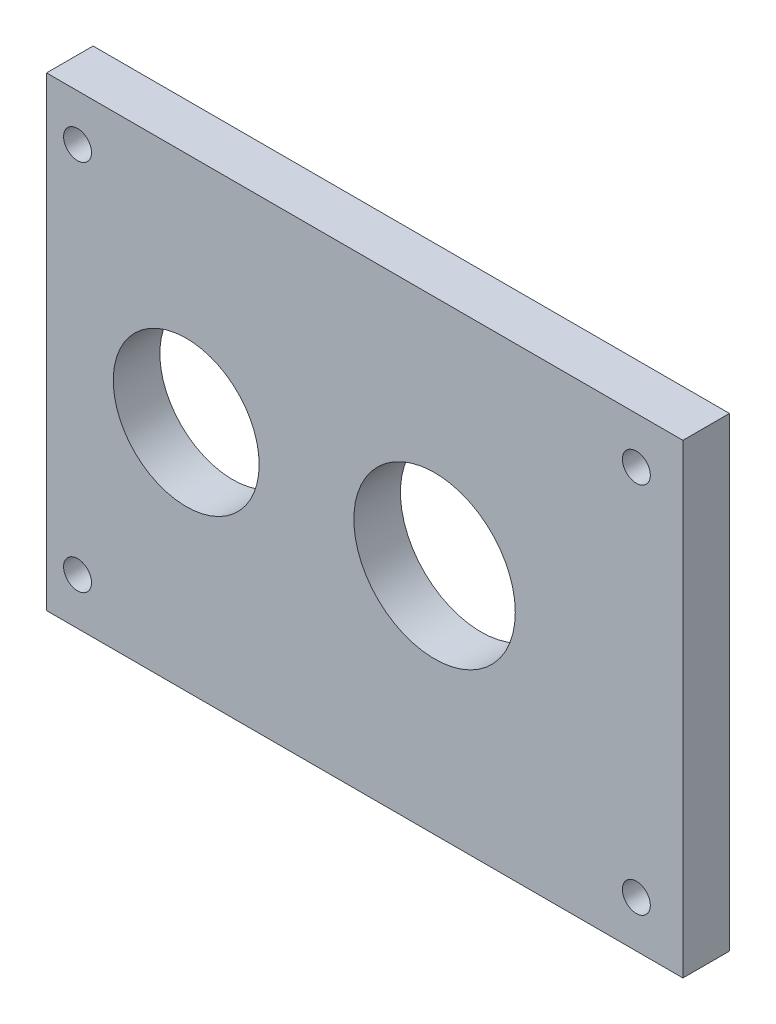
ISO-10303-21;
HEADER;
FILE_DESCRIPTION(('STEP AP214'),'2;1');
FILE_NAME('part.step','',(''),(''),'','','');
FILE_SCHEMA(('AUTOMOTIVE_DESIGN { 1 0 10303 214 1 1 1 1 }'));
ENDSEC;
DATA;
#1=APPLICATION_CONTEXT('core data for automotive mechanical design processes');
#2=APPLICATION_PROTOCOL_DEFINITION('international standard','automotive_design',2000,#1);
#3=PRODUCT_CONTEXT('',#1,'mechanical');
#4=PRODUCT('Part','Part','',(#3));
#5=PRODUCT_RELATED_PRODUCT_CATEGORY('part','',(#4));
#6=PRODUCT_DEFINITION_FORMATION('','',#4);
#7=PRODUCT_DEFINITION_CONTEXT('part definition',#1,'design');
#8=PRODUCT_DEFINITION('design','',#6,#7);
#9=PRODUCT_DEFINITION_SHAPE('','',#8);
#10=(LENGTH_UNIT() NAMED_UNIT(*) SI_UNIT(.MILLI.,.METRE.));
#11=(NAMED_UNIT(*) PLANE_ANGLE_UNIT() SI_UNIT($,.RADIAN.));
#12=(NAMED_UNIT(*) SI_UNIT($,.STERADIAN.) SOLID_ANGLE_UNIT());
#13=UNCERTAINTY_MEASURE_WITH_UNIT(LENGTH_MEASURE(1.E-05),#10,'distance_accuracy_value','');
#14=(GEOMETRIC_REPRESENTATION_CONTEXT(3) GLOBAL_UNCERTAINTY_ASSIGNED_CONTEXT((#13)) GLOBAL_UNIT_ASSIGNED_CONTEXT((#10,
#11,#12)) REPRESENTATION_CONTEXT('',''));
#15=CARTESIAN_POINT('',(0.,0.,0.));
#16=DIRECTION('',(0.,0.,1.));
#17=DIRECTION('',(1.,0.,0.));
#18=AXIS2_PLACEMENT_3D('',#15,#16,#17);
#19=CARTESIAN_POINT('',(-45.,-75.,15.));
#20=DIRECTION('',(1.,0.,0.));
#21=DIRECTION('',(0.,0.,-1.));
#22=AXIS2_PLACEMENT_3D('',#19,#20,#21);
#23=PLANE('',#22);
#24=DIRECTION('',(0.,-1.,0.));
#25=VECTOR('',#24,1.);
#26=CARTESIAN_POINT('',(-45.,-75.,0.));
#27=LINE('',#26,#25);
#28=CARTESIAN_POINT('',(-45.,75.,0.));
#29=VERTEX_POINT('',#28);
#30=CARTESIAN_POINT('',(-45.,-75.,0.));
#31=VERTEX_POINT('',#30);
#32=EDGE_CURVE('E109',#29,#31,#27,.T.);
#33=ORIENTED_EDGE('',*,*,#32,.T.);
#34=DIRECTION('',(0.,0.,-1.));
#35=VECTOR('',#34,1.);
#36=CARTESIAN_POINT('',(-45.,-75.,15.));
#37=LINE('',#36,#35);
#38=CARTESIAN_POINT('',(-45.,-75.,15.));
#39=VERTEX_POINT('',#38);
#40=EDGE_CURVE('E11',#39,#31,#37,.T.);
#41=ORIENTED_EDGE('',*,*,#40,.F.);
#42=DIRECTION('',(0.,-1.,0.));
#43=VECTOR('',#42,1.);
#44=CARTESIAN_POINT('',(-45.,-75.,15.));
#45=LINE('',#44,#43);
#46=CARTESIAN_POINT('',(-45.,75.,15.));
#47=VERTEX_POINT('',#46);
#48=EDGE_CURVE('E96',#47,#39,#45,.T.);
#49=ORIENTED_EDGE('',*,*,#48,.F.);
#50=DIRECTION('',(0.,0.,-1.));
#51=VECTOR('',#50,1.);
#52=CARTESIAN_POINT('',(-45.,75.,15.));
#53=LINE('',#52,#51);
#54=EDGE_CURVE('E105',#47,#29,#53,.T.);
#55=ORIENTED_EDGE('',*,*,#54,.T.);
#56=EDGE_LOOP('',(#33,#41,#49,#55));
#57=FACE_BOUND('',#56,.T.);
#58=ADVANCED_FACE('F43',(#57),#23,.F.);
#59=CARTESIAN_POINT('',(-45.,-75.,15.));
#60=DIRECTION('',(0.,1.,0.));
#61=DIRECTION('',(0.,0.,1.));
#62=AXIS2_PLACEMENT_3D('',#59,#60,#61);
#63=PLANE('',#62);
#64=DIRECTION('',(1.,0.,0.));
#65=VECTOR('',#64,1.);
#66=CARTESIAN_POINT('',(-45.,-75.,0.));
#67=LINE('',#66,#65);
#68=CARTESIAN_POINT('',(160.,-75.,0.));
#69=VERTEX_POINT('',#68);
#70=EDGE_CURVE('E100',#31,#69,#67,.T.);
#71=ORIENTED_EDGE('',*,*,#70,.T.);
#72=DIRECTION('',(0.,0.,-1.));
#73=VECTOR('',#72,1.);
#74=CARTESIAN_POINT('',(160.,-75.,15.));
#75=LINE('',#74,#73);
#76=CARTESIAN_POINT('',(160.,-75.,15.));
#77=VERTEX_POINT('',#76);
#78=EDGE_CURVE('E52',#77,#69,#75,.T.);
#79=ORIENTED_EDGE('',*,*,#78,.F.);
#80=DIRECTION('',(1.,0.,0.));
#81=VECTOR('',#80,1.);
#82=CARTESIAN_POINT('',(-45.,-75.,15.));
#83=LINE('',#82,#81);
#84=EDGE_CURVE('E91',#39,#77,#83,.T.);
#85=ORIENTED_EDGE('',*,*,#84,.F.);
#86=ORIENTED_EDGE('',*,*,#40,.T.);
#87=EDGE_LOOP('',(#71,#79,#85,#86));
#88=FACE_BOUND('',#87,.T.);
#89=ADVANCED_FACE('F99',(#88),#63,.F.);
#90=CARTESIAN_POINT('',(160.,-75.,15.));
#91=DIRECTION('',(-1.,0.,0.));
#92=DIRECTION('',(0.,0.,1.));
#93=AXIS2_PLACEMENT_3D('',#90,#91,#92);
#94=PLANE('',#93);
#95=DIRECTION('',(0.,1.,0.));
#96=VECTOR('',#95,1.);
#97=CARTESIAN_POINT('',(160.,-75.,0.));
#98=LINE('',#97,#96);
#99=CARTESIAN_POINT('',(160.,75.,0.));
#100=VERTEX_POINT('',#99);
#101=EDGE_CURVE('E78',#69,#100,#98,.T.);
#102=ORIENTED_EDGE('',*,*,#101,.T.);
#103=DIRECTION('',(0.,0.,-1.));
#104=VECTOR('',#103,1.);
#105=CARTESIAN_POINT('',(160.,75.,15.));
#106=LINE('',#105,#104);
#107=CARTESIAN_POINT('',(160.,75.,15.));
#108=VERTEX_POINT('',#107);
#109=EDGE_CURVE('E101',#108,#100,#106,.T.);
#110=ORIENTED_EDGE('',*,*,#109,.F.);
#111=DIRECTION('',(0.,1.,0.));
#112=VECTOR('',#111,1.);
#113=CARTESIAN_POINT('',(160.,-75.,15.));
#114=LINE('',#113,#112);
#115=EDGE_CURVE('E94',#77,#108,#114,.T.);
#116=ORIENTED_EDGE('',*,*,#115,.F.);
#117=ORIENTED_EDGE('',*,*,#78,.T.);
#118=EDGE_LOOP('',(#102,#110,#116,#117));
#119=FACE_BOUND('',#118,.T.);
#120=ADVANCED_FACE('F103',(#119),#94,.F.);
#121=CARTESIAN_POINT('',(-45.,75.,15.));
#122=DIRECTION('',(0.,-1.,0.));
#123=DIRECTION('',(0.,0.,-1.));
#124=AXIS2_PLACEMENT_3D('',#121,#122,#123);
#125=PLANE('',#124);
#126=DIRECTION('',(-1.,0.,0.));
#127=VECTOR('',#126,1.);
#128=CARTESIAN_POINT('',(-45.,75.,0.));
#129=LINE('',#128,#127);
#130=EDGE_CURVE('E84',#100,#29,#129,.T.);
#131=ORIENTED_EDGE('',*,*,#130,.T.);
#132=ORIENTED_EDGE('',*,*,#54,.F.);
#133=DIRECTION('',(-1.,0.,0.));
#134=VECTOR('',#133,1.);
#135=CARTESIAN_POINT('',(-45.,75.,15.));
#136=LINE('',#135,#134);
#137=EDGE_CURVE('E61',#108,#47,#136,.T.);
#138=ORIENTED_EDGE('',*,*,#137,.F.);
#139=ORIENTED_EDGE('',*,*,#109,.T.);
#140=EDGE_LOOP('',(#131,#132,#138,#139));
#141=FACE_BOUND('',#140,.T.);
#142=ADVANCED_FACE('F155',(#141),#125,.F.);
#143=CARTESIAN_POINT('',(0.,0.,15.));
#144=DIRECTION('',(0.,0.,-1.));
#145=DIRECTION('',(-1.,0.,0.));
#146=AXIS2_PLACEMENT_3D('',#143,#144,#145);
#147=PLANE('',#146);
#148=CARTESIAN_POINT('',(-35.,60.,15.));
#149=DIRECTION('',(0.,0.,1.));
#150=DIRECTION('',(1.,0.,0.));
#151=AXIS2_PLACEMENT_3D('',#148,#149,#150);
#152=CIRCLE('',#151,4.5);
#153=CARTESIAN_POINT('',(-30.5,60.,15.));
#154=VERTEX_POINT('',#153);
#155=EDGE_CURVE('E258',#154,#154,#152,.T.);
#156=ORIENTED_EDGE('',*,*,#155,.F.);
#157=EDGE_LOOP('',(#156));
#158=FACE_BOUND('',#157,.T.);
#159=CARTESIAN_POINT('',(145.,-60.,15.));
#160=DIRECTION('',(0.,0.,1.));
#161=DIRECTION('',(1.,0.,0.));
#162=AXIS2_PLACEMENT_3D('',#159,#160,#161);
#163=CIRCLE('',#162,4.49999999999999);
#164=CARTESIAN_POINT('',(149.5,-60.,15.));
#165=VERTEX_POINT('',#164);
#166=EDGE_CURVE('E255',#165,#165,#163,.T.);
#167=ORIENTED_EDGE('',*,*,#166,.F.);
#168=EDGE_LOOP('',(#167));
#169=FACE_BOUND('',#168,.T.);
#170=CARTESIAN_POINT('',(-35.,-60.,15.));
#171=DIRECTION('',(0.,0.,1.));
#172=DIRECTION('',(1.,0.,0.));
#173=AXIS2_PLACEMENT_3D('',#170,#171,#172);
#174=CIRCLE('',#173,4.5);
#175=CARTESIAN_POINT('',(-30.5,-60.,15.));
#176=VERTEX_POINT('',#175);
#177=EDGE_CURVE('E257',#176,#176,#174,.T.);
#178=ORIENTED_EDGE('',*,*,#177,.F.);
#179=EDGE_LOOP('',(#178));
#180=FACE_BOUND('',#179,.T.);
#181=CARTESIAN_POINT('',(80.,0.,15.));
#182=DIRECTION('',(0.,0.,1.));
#183=DIRECTION('',(1.,0.,0.));
#184=AXIS2_PLACEMENT_3D('',#181,#182,#183);
#185=CIRCLE('',#184,26.);
#186=CARTESIAN_POINT('',(106.,0.,15.));
#187=VERTEX_POINT('',#186);
#188=EDGE_CURVE('E261',#187,#187,#185,.T.);
#189=ORIENTED_EDGE('',*,*,#188,.F.);
#190=EDGE_LOOP('',(#189));
#191=FACE_BOUND('',#190,.T.);
#192=CARTESIAN_POINT('',(145.,60.,15.));
#193=DIRECTION('',(0.,0.,1.));
#194=DIRECTION('',(1.,0.,0.));
#195=AXIS2_PLACEMENT_3D('',#192,#193,#194);
#196=CIRCLE('',#195,4.49999999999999);
#197=CARTESIAN_POINT('',(149.5,60.,15.));
#198=VERTEX_POINT('',#197);
#199=EDGE_CURVE('E264',#198,#198,#196,.T.);
#200=ORIENTED_EDGE('',*,*,#199,.F.);
#201=EDGE_LOOP('',(#200));
#202=FACE_BOUND('',#201,.T.);
#203=CARTESIAN_POINT('',(0.,0.,15.));
#204=DIRECTION('',(0.,0.,1.));
#205=DIRECTION('',(1.,0.,0.));
#206=AXIS2_PLACEMENT_3D('',#203,#204,#205);
#207=CIRCLE('',#206,23.5);
#208=CARTESIAN_POINT('',(23.5,0.,15.));
#209=VERTEX_POINT('',#208);
#210=EDGE_CURVE('E121',#209,#209,#207,.T.);
#211=ORIENTED_EDGE('',*,*,#210,.F.);
#212=EDGE_LOOP('',(#211));
#213=FACE_BOUND('',#212,.T.);
#214=ORIENTED_EDGE('',*,*,#48,.T.);
#215=ORIENTED_EDGE('',*,*,#84,.T.);
#216=ORIENTED_EDGE('',*,*,#115,.T.);
#217=ORIENTED_EDGE('',*,*,#137,.T.);
#218=EDGE_LOOP('',(#214,#215,#216,#217));
#219=FACE_BOUND('',#218,.T.);
#220=ADVANCED_FACE('F92',(#158,#169,#180,#191,#202,#213,#219),#147,.F.);
#221=CARTESIAN_POINT('',(0.,0.,0.));
#222=DIRECTION('',(0.,0.,-1.));
#223=DIRECTION('',(-1.,0.,0.));
#224=AXIS2_PLACEMENT_3D('',#221,#222,#223);
#225=PLANE('',#224);
#226=CARTESIAN_POINT('',(-35.,60.,0.));
#227=DIRECTION('',(0.,0.,-1.));
#228=DIRECTION('',(-1.,0.,0.));
#229=AXIS2_PLACEMENT_3D('',#226,#227,#228);
#230=CIRCLE('',#229,4.5);
#231=CARTESIAN_POINT('',(-30.5,60.,0.));
#232=VERTEX_POINT('',#231);
#233=EDGE_CURVE('E46',#232,#232,#230,.T.);
#234=ORIENTED_EDGE('',*,*,#233,.F.);
#235=EDGE_LOOP('',(#234));
#236=FACE_BOUND('',#235,.T.);
#237=CARTESIAN_POINT('',(145.,-60.,0.));
#238=DIRECTION('',(0.,0.,-1.));
#239=DIRECTION('',(-1.,0.,0.));
#240=AXIS2_PLACEMENT_3D('',#237,#238,#239);
#241=CIRCLE('',#240,4.49999999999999);
#242=CARTESIAN_POINT('',(149.5,-60.,0.));
#243=VERTEX_POINT('',#242);
#244=EDGE_CURVE('E129',#243,#243,#241,.T.);
#245=ORIENTED_EDGE('',*,*,#244,.F.);
#246=EDGE_LOOP('',(#245));
#247=FACE_BOUND('',#246,.T.);
#248=CARTESIAN_POINT('',(-35.,-60.,0.));
#249=DIRECTION('',(0.,0.,-1.));
#250=DIRECTION('',(-1.,0.,0.));
#251=AXIS2_PLACEMENT_3D('',#248,#249,#250);
#252=CIRCLE('',#251,4.5);
#253=CARTESIAN_POINT('',(-30.5,-60.,0.));
#254=VERTEX_POINT('',#253);
#255=EDGE_CURVE('E127',#254,#254,#252,.T.);
#256=ORIENTED_EDGE('',*,*,#255,.F.);
#257=EDGE_LOOP('',(#256));
#258=FACE_BOUND('',#257,.T.);
#259=CARTESIAN_POINT('',(80.,0.,0.));
#260=DIRECTION('',(0.,0.,-1.));
#261=DIRECTION('',(-1.,0.,0.));
#262=AXIS2_PLACEMENT_3D('',#259,#260,#261);
#263=CIRCLE('',#262,26.);
#264=CARTESIAN_POINT('',(106.,0.,0.));
#265=VERTEX_POINT('',#264);
#266=EDGE_CURVE('E124',#265,#265,#263,.T.);
#267=ORIENTED_EDGE('',*,*,#266,.F.);
#268=EDGE_LOOP('',(#267));
#269=FACE_BOUND('',#268,.T.);
#270=CARTESIAN_POINT('',(145.,60.,0.));
#271=DIRECTION('',(0.,0.,-1.));
#272=DIRECTION('',(-1.,0.,0.));
#273=AXIS2_PLACEMENT_3D('',#270,#271,#272);
#274=CIRCLE('',#273,4.49999999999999);
#275=CARTESIAN_POINT('',(149.5,60.,0.));
#276=VERTEX_POINT('',#275);
#277=EDGE_CURVE('E120',#276,#276,#274,.T.);
#278=ORIENTED_EDGE('',*,*,#277,.F.);
#279=EDGE_LOOP('',(#278));
#280=FACE_BOUND('',#279,.T.);
#281=CARTESIAN_POINT('',(0.,0.,0.));
#282=DIRECTION('',(0.,0.,-1.));
#283=DIRECTION('',(-1.,0.,0.));
#284=AXIS2_PLACEMENT_3D('',#281,#282,#283);
#285=CIRCLE('',#284,23.5);
#286=CARTESIAN_POINT('',(23.5,0.,0.));
#287=VERTEX_POINT('',#286);
#288=EDGE_CURVE('E117',#287,#287,#285,.T.);
#289=ORIENTED_EDGE('',*,*,#288,.F.);
#290=EDGE_LOOP('',(#289));
#291=FACE_BOUND('',#290,.T.);
#292=ORIENTED_EDGE('',*,*,#32,.F.);
#293=ORIENTED_EDGE('',*,*,#130,.F.);
#294=ORIENTED_EDGE('',*,*,#101,.F.);
#295=ORIENTED_EDGE('',*,*,#70,.F.);
#296=EDGE_LOOP('',(#292,#293,#294,#295));
#297=FACE_BOUND('',#296,.T.);
#298=ADVANCED_FACE('F139',(#236,#247,#258,#269,#280,#291,#297),#225,.T.);
#299=CARTESIAN_POINT('',(0.,0.,-1.2E-05));
#300=DIRECTION('',(0.,0.,1.));
#301=DIRECTION('',(1.,0.,0.));
#302=AXIS2_PLACEMENT_3D('',#299,#300,#301);
#303=CYLINDRICAL_SURFACE('',#302,23.5);
#304=CARTESIAN_POINT('',(23.5,0.,0.));
#305=CARTESIAN_POINT('',(23.5,0.,0.15625));
#306=CARTESIAN_POINT('',(23.5,0.,0.3125));
#307=CARTESIAN_POINT('',(23.5,0.,0.625));
#308=CARTESIAN_POINT('',(23.5,0.,0.78125));
#309=CARTESIAN_POINT('',(23.5,0.,1.09375));
#310=CARTESIAN_POINT('',(23.5,0.,1.25));
#311=CARTESIAN_POINT('',(23.5,0.,1.5625));
#312=CARTESIAN_POINT('',(23.5,0.,1.71875));
#313=CARTESIAN_POINT('',(23.5,0.,2.03125));
#314=CARTESIAN_POINT('',(23.5,0.,2.1875));
#315=CARTESIAN_POINT('',(23.5,0.,2.5));
#316=CARTESIAN_POINT('',(23.5,0.,2.65625));
#317=CARTESIAN_POINT('',(23.5,0.,2.96875));
#318=CARTESIAN_POINT('',(23.5,0.,3.125));
#319=CARTESIAN_POINT('',(23.5,0.,3.4375));
#320=CARTESIAN_POINT('',(23.5,0.,3.59375));
#321=CARTESIAN_POINT('',(23.5,0.,3.90625));
#322=CARTESIAN_POINT('',(23.5,0.,4.0625));
#323=CARTESIAN_POINT('',(23.5,0.,4.375));
#324=CARTESIAN_POINT('',(23.5,0.,4.53125));
#325=CARTESIAN_POINT('',(23.5,0.,4.84375));
#326=CARTESIAN_POINT('',(23.5,0.,5.));
#327=CARTESIAN_POINT('',(23.5,0.,5.3125));
#328=CARTESIAN_POINT('',(23.5,0.,5.46875));
#329=CARTESIAN_POINT('',(23.5,0.,5.78125));
#330=CARTESIAN_POINT('',(23.5,0.,5.9375));
#331=CARTESIAN_POINT('',(23.5,0.,6.25));
#332=CARTESIAN_POINT('',(23.5,0.,6.40625));
#333=CARTESIAN_POINT('',(23.5,0.,6.71875));
#334=CARTESIAN_POINT('',(23.5,0.,6.875));
#335=CARTESIAN_POINT('',(23.5,0.,7.1875));
#336=CARTESIAN_POINT('',(23.5,0.,7.34375));
#337=CARTESIAN_POINT('',(23.5,0.,7.65625));
#338=CARTESIAN_POINT('',(23.5,0.,7.8125));
#339=CARTESIAN_POINT('',(23.5,0.,8.125));
#340=CARTESIAN_POINT('',(23.5,0.,8.28125));
#341=CARTESIAN_POINT('',(23.5,0.,8.59375));
#342=CARTESIAN_POINT('',(23.5,0.,8.75));
#343=CARTESIAN_POINT('',(23.5,0.,9.0625));
#344=CARTESIAN_POINT('',(23.5,0.,9.21875));
#345=CARTESIAN_POINT('',(23.5,0.,9.53125));
#346=CARTESIAN_POINT('',(23.5,0.,9.6875));
#347=CARTESIAN_POINT('',(23.5,0.,10.));
#348=CARTESIAN_POINT('',(23.5,0.,10.15625));
#349=CARTESIAN_POINT('',(23.5,0.,10.46875));
#350=CARTESIAN_POINT('',(23.5,0.,10.625));
#351=CARTESIAN_POINT('',(23.5,0.,10.9375));
#352=CARTESIAN_POINT('',(23.5,0.,11.09375));
#353=CARTESIAN_POINT('',(23.5,0.,11.40625));
#354=CARTESIAN_POINT('',(23.5,0.,11.5625));
#355=CARTESIAN_POINT('',(23.5,0.,11.875));
#356=CARTESIAN_POINT('',(23.5,0.,12.03125));
#357=CARTESIAN_POINT('',(23.5,0.,12.34375));
#358=CARTESIAN_POINT('',(23.5,0.,12.5));
#359=CARTESIAN_POINT('',(23.5,0.,12.8125));
#360=CARTESIAN_POINT('',(23.5,0.,12.96875));
#361=CARTESIAN_POINT('',(23.5,0.,13.28125));
#362=CARTESIAN_POINT('',(23.5,0.,13.4375));
#363=CARTESIAN_POINT('',(23.5,0.,13.75));
#364=CARTESIAN_POINT('',(23.5,0.,13.90625));
#365=CARTESIAN_POINT('',(23.5,0.,14.21875));
#366=CARTESIAN_POINT('',(23.5,0.,14.375));
#367=CARTESIAN_POINT('',(23.5,0.,14.6875));
#368=CARTESIAN_POINT('',(23.5,0.,14.84375));
#369=CARTESIAN_POINT('',(23.5,0.,15.));
#370=B_SPLINE_CURVE_WITH_KNOTS('',3,(#304,#305,#306,#307,#308,#309,#310,#311,#312,#313,#314,
#315,#316,#317,#318,#319,#320,#321,#322,#323,#324,#325,#326,#327,#328,#329,#330,#331,#332,#333,
#334,#335,#336,#337,#338,#339,#340,#341,#342,#343,#344,#345,#346,#347,#348,#349,#350,#351,#352,
#353,#354,#355,#356,#357,#358,#359,#360,#361,#362,#363,#364,#365,#366,#367,#368,#369),
.UNSPECIFIED.,.F.,.F.,(4,2,2,2,2,2,2,2,2,2,2,2,2,2,2,2,2,2,2,2,2,2,2,2,2,2,2,2,2,2,2,2,4),(0.,
0.46875,0.9375,1.40625,1.875,2.34375,2.8125,3.28125,3.75,4.21875,4.6875,5.15625,5.625,6.09375,
6.5625,7.03125,7.5,7.96875,8.4375,8.90625,9.375,9.84375,10.3125,10.78125,11.25,11.71875,12.1875,
12.65625,13.125,13.59375,14.0625,14.53125,15.),.UNSPECIFIED.);
#371=EDGE_CURVE('BSEAM142',#287,#209,#370,.T.);
#372=ORIENTED_EDGE('',*,*,#288,.T.);
#373=ORIENTED_EDGE('',*,*,#210,.T.);
#374=ORIENTED_EDGE('',*,*,#371,.T.);
#375=ORIENTED_EDGE('',*,*,#371,.F.);
#376=EDGE_LOOP('',(#372,#374,#373,#375));
#377=FACE_BOUND('',#376,.T.);
#378=ADVANCED_FACE('F142',(#377),#303,.F.);
#379=CARTESIAN_POINT('',(145.,60.,-1.2E-05));
#380=DIRECTION('',(0.,0.,1.));
#381=DIRECTION('',(1.,0.,0.));
#382=AXIS2_PLACEMENT_3D('',#379,#380,#381);
#383=CYLINDRICAL_SURFACE('',#382,4.49999999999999);
#384=CARTESIAN_POINT('',(149.5,60.,0.));
#385=CARTESIAN_POINT('',(149.5,60.,0.15625));
#386=CARTESIAN_POINT('',(149.5,60.,0.3125));
#387=CARTESIAN_POINT('',(149.5,60.,0.625));
#388=CARTESIAN_POINT('',(149.5,60.,0.78125));
#389=CARTESIAN_POINT('',(149.5,60.,1.09375));
#390=CARTESIAN_POINT('',(149.5,60.,1.25));
#391=CARTESIAN_POINT('',(149.5,60.,1.5625));
#392=CARTESIAN_POINT('',(149.5,60.,1.71875));
#393=CARTESIAN_POINT('',(149.5,60.,2.03125));
#394=CARTESIAN_POINT('',(149.5,60.,2.1875));
#395=CARTESIAN_POINT('',(149.5,60.,2.5));
#396=CARTESIAN_POINT('',(149.5,60.,2.65625));
#397=CARTESIAN_POINT('',(149.5,60.,2.96875));
#398=CARTESIAN_POINT('',(149.5,60.,3.125));
#399=CARTESIAN_POINT('',(149.5,60.,3.4375));
#400=CARTESIAN_POINT('',(149.5,60.,3.59375));
#401=CARTESIAN_POINT('',(149.5,60.,3.90625));
#402=CARTESIAN_POINT('',(149.5,60.,4.0625));
#403=CARTESIAN_POINT('',(149.5,60.,4.375));
#404=CARTESIAN_POINT('',(149.5,60.,4.53125));
#405=CARTESIAN_POINT('',(149.5,60.,4.84375));
#406=CARTESIAN_POINT('',(149.5,60.,5.));
#407=CARTESIAN_POINT('',(149.5,60.,5.3125));
#408=CARTESIAN_POINT('',(149.5,60.,5.46875));
#409=CARTESIAN_POINT('',(149.5,60.,5.78125));
#410=CARTESIAN_POINT('',(149.5,60.,5.9375));
#411=CARTESIAN_POINT('',(149.5,60.,6.25));
#412=CARTESIAN_POINT('',(149.5,60.,6.40625));
#413=CARTESIAN_POINT('',(149.5,60.,6.71875));
#414=CARTESIAN_POINT('',(149.5,60.,6.875));
#415=CARTESIAN_POINT('',(149.5,60.,7.1875));
#416=CARTESIAN_POINT('',(149.5,60.,7.34375));
#417=CARTESIAN_POINT('',(149.5,60.,7.65625));
#418=CARTESIAN_POINT('',(149.5,60.,7.8125));
#419=CARTESIAN_POINT('',(149.5,60.,8.125));
#420=CARTESIAN_POINT('',(149.5,60.,8.28125));
#421=CARTESIAN_POINT('',(149.5,60.,8.59375));
#422=CARTESIAN_POINT('',(149.5,60.,8.75));
#423=CARTESIAN_POINT('',(149.5,60.,9.0625));
#424=CARTESIAN_POINT('',(149.5,60.,9.21875));
#425=CARTESIAN_POINT('',(149.5,60.,9.53125));
#426=CARTESIAN_POINT('',(149.5,60.,9.6875));
#427=CARTESIAN_POINT('',(149.5,60.,10.));
#428=CARTESIAN_POINT('',(149.5,60.,10.15625));
#429=CARTESIAN_POINT('',(149.5,60.,10.46875));
#430=CARTESIAN_POINT('',(149.5,60.,10.625));
#431=CARTESIAN_POINT('',(149.5,60.,10.9375));
#432=CARTESIAN_POINT('',(149.5,60.,11.09375));
#433=CARTESIAN_POINT('',(149.5,60.,11.40625));
#434=CARTESIAN_POINT('',(149.5,60.,11.5625));
#435=CARTESIAN_POINT('',(149.5,60.,11.875));
#436=CARTESIAN_POINT('',(149.5,60.,12.03125));
#437=CARTESIAN_POINT('',(149.5,60.,12.34375));
#438=CARTESIAN_POINT('',(149.5,60.,12.5));
#439=CARTESIAN_POINT('',(149.5,60.,12.8125));
#440=CARTESIAN_POINT('',(149.5,60.,12.96875));
#441=CARTESIAN_POINT('',(149.5,60.,13.28125));
#442=CARTESIAN_POINT('',(149.5,60.,13.4375));
#443=CARTESIAN_POINT('',(149.5,60.,13.75));
#444=CARTESIAN_POINT('',(149.5,60.,13.90625));
#445=CARTESIAN_POINT('',(149.5,60.,14.21875));
#446=CARTESIAN_POINT('',(149.5,60.,14.375));
#447=CARTESIAN_POINT('',(149.5,60.,14.6875));
#448=CARTESIAN_POINT('',(149.5,60.,14.84375));
#449=CARTESIAN_POINT('',(149.5,60.,15.));
#450=B_SPLINE_CURVE_WITH_KNOTS('',3,(#384,#385,#386,#387,#388,#389,#390,#391,#392,#393,#394,
#395,#396,#397,#398,#399,#400,#401,#402,#403,#404,#405,#406,#407,#408,#409,#410,#411,#412,#413,
#414,#415,#416,#417,#418,#419,#420,#421,#422,#423,#424,#425,#426,#427,#428,#429,#430,#431,#432,
#433,#434,#435,#436,#437,#438,#439,#440,#441,#442,#443,#444,#445,#446,#447,#448,#449),
.UNSPECIFIED.,.F.,.F.,(4,2,2,2,2,2,2,2,2,2,2,2,2,2,2,2,2,2,2,2,2,2,2,2,2,2,2,2,2,2,2,2,4),(0.,
0.46875,0.9375,1.40625,1.875,2.34375,2.8125,3.28125,3.75,4.21875,4.6875,5.15625,5.625,6.09375,
6.5625,7.03125,7.5,7.96875,8.4375,8.90625,9.375,9.84375,10.3125,10.78125,11.25,11.71875,12.1875,
12.65625,13.125,13.59375,14.0625,14.53125,15.),.UNSPECIFIED.);
#451=EDGE_CURVE('BSEAM202',#276,#198,#450,.T.);
#452=ORIENTED_EDGE('',*,*,#277,.T.);
#453=ORIENTED_EDGE('',*,*,#199,.T.);
#454=ORIENTED_EDGE('',*,*,#451,.T.);
#455=ORIENTED_EDGE('',*,*,#451,.F.);
#456=EDGE_LOOP('',(#452,#454,#453,#455));
#457=FACE_BOUND('',#456,.T.);
#458=ADVANCED_FACE('F202',(#457),#383,.F.);
#459=CARTESIAN_POINT('',(80.,0.,-1.2E-05));
#460=DIRECTION('',(0.,0.,1.));
#461=DIRECTION('',(1.,0.,0.));
#462=AXIS2_PLACEMENT_3D('',#459,#460,#461);
#463=CYLINDRICAL_SURFACE('',#462,26.);
#464=CARTESIAN_POINT('',(106.,0.,0.));
#465=CARTESIAN_POINT('',(106.,0.,0.15625));
#466=CARTESIAN_POINT('',(106.,0.,0.3125));
#467=CARTESIAN_POINT('',(106.,0.,0.625));
#468=CARTESIAN_POINT('',(106.,0.,0.78125));
#469=CARTESIAN_POINT('',(106.,0.,1.09375));
#470=CARTESIAN_POINT('',(106.,0.,1.25));
#471=CARTESIAN_POINT('',(106.,0.,1.5625));
#472=CARTESIAN_POINT('',(106.,0.,1.71875));
#473=CARTESIAN_POINT('',(106.,0.,2.03125));
#474=CARTESIAN_POINT('',(106.,0.,2.1875));
#475=CARTESIAN_POINT('',(106.,0.,2.5));
#476=CARTESIAN_POINT('',(106.,0.,2.65625));
#477=CARTESIAN_POINT('',(106.,0.,2.96875));
#478=CARTESIAN_POINT('',(106.,0.,3.125));
#479=CARTESIAN_POINT('',(106.,0.,3.4375));
#480=CARTESIAN_POINT('',(106.,0.,3.59375));
#481=CARTESIAN_POINT('',(106.,0.,3.90625));
#482=CARTESIAN_POINT('',(106.,0.,4.0625));
#483=CARTESIAN_POINT('',(106.,0.,4.375));
#484=CARTESIAN_POINT('',(106.,0.,4.53125));
#485=CARTESIAN_POINT('',(106.,0.,4.84375));
#486=CARTESIAN_POINT('',(106.,0.,5.));
#487=CARTESIAN_POINT('',(106.,0.,5.3125));
#488=CARTESIAN_POINT('',(106.,0.,5.46875));
#489=CARTESIAN_POINT('',(106.,0.,5.78125));
#490=CARTESIAN_POINT('',(106.,0.,5.9375));
#491=CARTESIAN_POINT('',(106.,0.,6.25));
#492=CARTESIAN_POINT('',(106.,0.,6.40625));
#493=CARTESIAN_POINT('',(106.,0.,6.71875));
#494=CARTESIAN_POINT('',(106.,0.,6.875));
#495=CARTESIAN_POINT('',(106.,0.,7.1875));
#496=CARTESIAN_POINT('',(106.,0.,7.34375));
#497=CARTESIAN_POINT('',(106.,0.,7.65625));
#498=CARTESIAN_POINT('',(106.,0.,7.8125));
#499=CARTESIAN_POINT('',(106.,0.,8.125));
#500=CARTESIAN_POINT('',(106.,0.,8.28125));
#501=CARTESIAN_POINT('',(106.,0.,8.59375));
#502=CARTESIAN_POINT('',(106.,0.,8.75));
#503=CARTESIAN_POINT('',(106.,0.,9.0625));
#504=CARTESIAN_POINT('',(106.,0.,9.21875));
#505=CARTESIAN_POINT('',(106.,0.,9.53125));
#506=CARTESIAN_POINT('',(106.,0.,9.6875));
#507=CARTESIAN_POINT('',(106.,0.,10.));
#508=CARTESIAN_POINT('',(106.,0.,10.15625));
#509=CARTESIAN_POINT('',(106.,0.,10.46875));
#510=CARTESIAN_POINT('',(106.,0.,10.625));
#511=CARTESIAN_POINT('',(106.,0.,10.9375));
#512=CARTESIAN_POINT('',(106.,0.,11.09375));
#513=CARTESIAN_POINT('',(106.,0.,11.40625));
#514=CARTESIAN_POINT('',(106.,0.,11.5625));
#515=CARTESIAN_POINT('',(106.,0.,11.875));
#516=CARTESIAN_POINT('',(106.,0.,12.03125));
#517=CARTESIAN_POINT('',(106.,0.,12.34375));
#518=CARTESIAN_POINT('',(106.,0.,12.5));
#519=CARTESIAN_POINT('',(106.,0.,12.8125));
#520=CARTESIAN_POINT('',(106.,0.,12.96875));
#521=CARTESIAN_POINT('',(106.,0.,13.28125));
#522=CARTESIAN_POINT('',(106.,0.,13.4375));
#523=CARTESIAN_POINT('',(106.,0.,13.75));
#524=CARTESIAN_POINT('',(106.,0.,13.90625));
#525=CARTESIAN_POINT('',(106.,0.,14.21875));
#526=CARTESIAN_POINT('',(106.,0.,14.375));
#527=CARTESIAN_POINT('',(106.,0.,14.6875));
#528=CARTESIAN_POINT('',(106.,0.,14.84375));
#529=CARTESIAN_POINT('',(106.,0.,15.));
#530=B_SPLINE_CURVE_WITH_KNOTS('',3,(#464,#465,#466,#467,#468,#469,#470,#471,#472,#473,#474,
#475,#476,#477,#478,#479,#480,#481,#482,#483,#484,#485,#486,#487,#488,#489,#490,#491,#492,#493,
#494,#495,#496,#497,#498,#499,#500,#501,#502,#503,#504,#505,#506,#507,#508,#509,#510,#511,#512,
#513,#514,#515,#516,#517,#518,#519,#520,#521,#522,#523,#524,#525,#526,#527,#528,#529),
.UNSPECIFIED.,.F.,.F.,(4,2,2,2,2,2,2,2,2,2,2,2,2,2,2,2,2,2,2,2,2,2,2,2,2,2,2,2,2,2,2,2,4),(0.,
0.46875,0.9375,1.40625,1.875,2.34375,2.8125,3.28125,3.75,4.21875,4.6875,5.15625,5.625,6.09375,
6.5625,7.03125,7.5,7.96875,8.4375,8.90625,9.375,9.84375,10.3125,10.78125,11.25,11.71875,12.1875,
12.65625,13.125,13.59375,14.0625,14.53125,15.),.UNSPECIFIED.);
#531=EDGE_CURVE('BSEAM212',#265,#187,#530,.T.);
#532=ORIENTED_EDGE('',*,*,#266,.T.);
#533=ORIENTED_EDGE('',*,*,#188,.T.);
#534=ORIENTED_EDGE('',*,*,#531,.T.);
#535=ORIENTED_EDGE('',*,*,#531,.F.);
#536=EDGE_LOOP('',(#532,#534,#533,#535));
#537=FACE_BOUND('',#536,.T.);
#538=ADVANCED_FACE('F212',(#537),#463,.F.);
#539=CARTESIAN_POINT('',(-35.,-60.,-1.2E-05));
#540=DIRECTION('',(0.,0.,1.));
#541=DIRECTION('',(1.,0.,0.));
#542=AXIS2_PLACEMENT_3D('',#539,#540,#541);
#543=CYLINDRICAL_SURFACE('',#542,4.5);
#544=CARTESIAN_POINT('',(-30.5,-60.,0.));
#545=CARTESIAN_POINT('',(-30.5,-60.,0.15625));
#546=CARTESIAN_POINT('',(-30.5,-60.,0.3125));
#547=CARTESIAN_POINT('',(-30.5,-60.,0.625));
#548=CARTESIAN_POINT('',(-30.5,-60.,0.78125));
#549=CARTESIAN_POINT('',(-30.5,-60.,1.09375));
#550=CARTESIAN_POINT('',(-30.5,-60.,1.25));
#551=CARTESIAN_POINT('',(-30.5,-60.,1.5625));
#552=CARTESIAN_POINT('',(-30.5,-60.,1.71875));
#553=CARTESIAN_POINT('',(-30.5,-60.,2.03125));
#554=CARTESIAN_POINT('',(-30.5,-60.,2.1875));
#555=CARTESIAN_POINT('',(-30.5,-60.,2.5));
#556=CARTESIAN_POINT('',(-30.5,-60.,2.65625));
#557=CARTESIAN_POINT('',(-30.5,-60.,2.96875));
#558=CARTESIAN_POINT('',(-30.5,-60.,3.125));
#559=CARTESIAN_POINT('',(-30.5,-60.,3.4375));
#560=CARTESIAN_POINT('',(-30.5,-60.,3.59375));
#561=CARTESIAN_POINT('',(-30.5,-60.,3.90625));
#562=CARTESIAN_POINT('',(-30.5,-60.,4.0625));
#563=CARTESIAN_POINT('',(-30.5,-60.,4.375));
#564=CARTESIAN_POINT('',(-30.5,-60.,4.53125));
#565=CARTESIAN_POINT('',(-30.5,-60.,4.84375));
#566=CARTESIAN_POINT('',(-30.5,-60.,5.));
#567=CARTESIAN_POINT('',(-30.5,-60.,5.3125));
#568=CARTESIAN_POINT('',(-30.5,-60.,5.46875));
#569=CARTESIAN_POINT('',(-30.5,-60.,5.78125));
#570=CARTESIAN_POINT('',(-30.5,-60.,5.9375));
#571=CARTESIAN_POINT('',(-30.5,-60.,6.25));
#572=CARTESIAN_POINT('',(-30.5,-60.,6.40625));
#573=CARTESIAN_POINT('',(-30.5,-60.,6.71875));
#574=CARTESIAN_POINT('',(-30.5,-60.,6.875));
#575=CARTESIAN_POINT('',(-30.5,-60.,7.1875));
#576=CARTESIAN_POINT('',(-30.5,-60.,7.34375));
#577=CARTESIAN_POINT('',(-30.5,-60.,7.65625));
#578=CARTESIAN_POINT('',(-30.5,-60.,7.8125));
#579=CARTESIAN_POINT('',(-30.5,-60.,8.125));
#580=CARTESIAN_POINT('',(-30.5,-60.,8.28125));
#581=CARTESIAN_POINT('',(-30.5,-60.,8.59375));
#582=CARTESIAN_POINT('',(-30.5,-60.,8.75));
#583=CARTESIAN_POINT('',(-30.5,-60.,9.0625));
#584=CARTESIAN_POINT('',(-30.5,-60.,9.21875));
#585=CARTESIAN_POINT('',(-30.5,-60.,9.53125));
#586=CARTESIAN_POINT('',(-30.5,-60.,9.6875));
#587=CARTESIAN_POINT('',(-30.5,-60.,10.));
#588=CARTESIAN_POINT('',(-30.5,-60.,10.15625));
#589=CARTESIAN_POINT('',(-30.5,-60.,10.46875));
#590=CARTESIAN_POINT('',(-30.5,-60.,10.625));
#591=CARTESIAN_POINT('',(-30.5,-60.,10.9375));
#592=CARTESIAN_POINT('',(-30.5,-60.,11.09375));
#593=CARTESIAN_POINT('',(-30.5,-60.,11.40625));
#594=CARTESIAN_POINT('',(-30.5,-60.,11.5625));
#595=CARTESIAN_POINT('',(-30.5,-60.,11.875));
#596=CARTESIAN_POINT('',(-30.5,-60.,12.03125));
#597=CARTESIAN_POINT('',(-30.5,-60.,12.34375));
#598=CARTESIAN_POINT('',(-30.5,-60.,12.5));
#599=CARTESIAN_POINT('',(-30.5,-60.,12.8125));
#600=CARTESIAN_POINT('',(-30.5,-60.,12.96875));
#601=CARTESIAN_POINT('',(-30.5,-60.,13.28125));
#602=CARTESIAN_POINT('',(-30.5,-60.,13.4375));
#603=CARTESIAN_POINT('',(-30.5,-60.,13.75));
#604=CARTESIAN_POINT('',(-30.5,-60.,13.90625));
#605=CARTESIAN_POINT('',(-30.5,-60.,14.21875));
#606=CARTESIAN_POINT('',(-30.5,-60.,14.375));
#607=CARTESIAN_POINT('',(-30.5,-60.,14.6875));
#608=CARTESIAN_POINT('',(-30.5,-60.,14.84375));
#609=CARTESIAN_POINT('',(-30.5,-60.,15.));
#610=B_SPLINE_CURVE_WITH_KNOTS('',3,(#544,#545,#546,#547,#548,#549,#550,#551,#552,#553,#554,
#555,#556,#557,#558,#559,#560,#561,#562,#563,#564,#565,#566,#567,#568,#569,#570,#571,#572,#573,
#574,#575,#576,#577,#578,#579,#580,#581,#582,#583,#584,#585,#586,#587,#588,#589,#590,#591,#592,
#593,#594,#595,#596,#597,#598,#599,#600,#601,#602,#603,#604,#605,#606,#607,#608,#609),
.UNSPECIFIED.,.F.,.F.,(4,2,2,2,2,2,2,2,2,2,2,2,2,2,2,2,2,2,2,2,2,2,2,2,2,2,2,2,2,2,2,2,4),(0.,
0.46875,0.9375,1.40625,1.875,2.34375,2.8125,3.28125,3.75,4.21875,4.6875,5.15625,5.625,6.09375,
6.5625,7.03125,7.5,7.96875,8.4375,8.90625,9.375,9.84375,10.3125,10.78125,11.25,11.71875,12.1875,
12.65625,13.125,13.59375,14.0625,14.53125,15.),.UNSPECIFIED.);
#611=EDGE_CURVE('BSEAM222',#254,#176,#610,.T.);
#612=ORIENTED_EDGE('',*,*,#255,.T.);
#613=ORIENTED_EDGE('',*,*,#177,.T.);
#614=ORIENTED_EDGE('',*,*,#611,.T.);
#615=ORIENTED_EDGE('',*,*,#611,.F.);
#616=EDGE_LOOP('',(#612,#614,#613,#615));
#617=FACE_BOUND('',#616,.T.);
#618=ADVANCED_FACE('F222',(#617),#543,.F.);
#619=CARTESIAN_POINT('',(145.,-60.,-1.2E-05));
#620=DIRECTION('',(0.,0.,1.));
#621=DIRECTION('',(1.,0.,0.));
#622=AXIS2_PLACEMENT_3D('',#619,#620,#621);
#623=CYLINDRICAL_SURFACE('',#622,4.49999999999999);
#624=CARTESIAN_POINT('',(149.5,-60.,0.));
#625=CARTESIAN_POINT('',(149.5,-60.,0.15625));
#626=CARTESIAN_POINT('',(149.5,-60.,0.3125));
#627=CARTESIAN_POINT('',(149.5,-60.,0.625));
#628=CARTESIAN_POINT('',(149.5,-60.,0.78125));
#629=CARTESIAN_POINT('',(149.5,-60.,1.09375));
#630=CARTESIAN_POINT('',(149.5,-60.,1.25));
#631=CARTESIAN_POINT('',(149.5,-60.,1.5625));
#632=CARTESIAN_POINT('',(149.5,-60.,1.71875));
#633=CARTESIAN_POINT('',(149.5,-60.,2.03125));
#634=CARTESIAN_POINT('',(149.5,-60.,2.1875));
#635=CARTESIAN_POINT('',(149.5,-60.,2.5));
#636=CARTESIAN_POINT('',(149.5,-60.,2.65625));
#637=CARTESIAN_POINT('',(149.5,-60.,2.96875));
#638=CARTESIAN_POINT('',(149.5,-60.,3.125));
#639=CARTESIAN_POINT('',(149.5,-60.,3.4375));
#640=CARTESIAN_POINT('',(149.5,-60.,3.59375));
#641=CARTESIAN_POINT('',(149.5,-60.,3.90625));
#642=CARTESIAN_POINT('',(149.5,-60.,4.0625));
#643=CARTESIAN_POINT('',(149.5,-60.,4.375));
#644=CARTESIAN_POINT('',(149.5,-60.,4.53125));
#645=CARTESIAN_POINT('',(149.5,-60.,4.84375));
#646=CARTESIAN_POINT('',(149.5,-60.,5.));
#647=CARTESIAN_POINT('',(149.5,-60.,5.3125));
#648=CARTESIAN_POINT('',(149.5,-60.,5.46875));
#649=CARTESIAN_POINT('',(149.5,-60.,5.78125));
#650=CARTESIAN_POINT('',(149.5,-60.,5.9375));
#651=CARTESIAN_POINT('',(149.5,-60.,6.25));
#652=CARTESIAN_POINT('',(149.5,-60.,6.40625));
#653=CARTESIAN_POINT('',(149.5,-60.,6.71875));
#654=CARTESIAN_POINT('',(149.5,-60.,6.875));
#655=CARTESIAN_POINT('',(149.5,-60.,7.1875));
#656=CARTESIAN_POINT('',(149.5,-60.,7.34375));
#657=CARTESIAN_POINT('',(149.5,-60.,7.65625));
#658=CARTESIAN_POINT('',(149.5,-60.,7.8125));
#659=CARTESIAN_POINT('',(149.5,-60.,8.125));
#660=CARTESIAN_POINT('',(149.5,-60.,8.28125));
#661=CARTESIAN_POINT('',(149.5,-60.,8.59375));
#662=CARTESIAN_POINT('',(149.5,-60.,8.75));
#663=CARTESIAN_POINT('',(149.5,-60.,9.0625));
#664=CARTESIAN_POINT('',(149.5,-60.,9.21875));
#665=CARTESIAN_POINT('',(149.5,-60.,9.53125));
#666=CARTESIAN_POINT('',(149.5,-60.,9.6875));
#667=CARTESIAN_POINT('',(149.5,-60.,10.));
#668=CARTESIAN_POINT('',(149.5,-60.,10.15625));
#669=CARTESIAN_POINT('',(149.5,-60.,10.46875));
#670=CARTESIAN_POINT('',(149.5,-60.,10.625));
#671=CARTESIAN_POINT('',(149.5,-60.,10.9375));
#672=CARTESIAN_POINT('',(149.5,-60.,11.09375));
#673=CARTESIAN_POINT('',(149.5,-60.,11.40625));
#674=CARTESIAN_POINT('',(149.5,-60.,11.5625));
#675=CARTESIAN_POINT('',(149.5,-60.,11.875));
#676=CARTESIAN_POINT('',(149.5,-60.,12.03125));
#677=CARTESIAN_POINT('',(149.5,-60.,12.34375));
#678=CARTESIAN_POINT('',(149.5,-60.,12.5));
#679=CARTESIAN_POINT('',(149.5,-60.,12.8125));
#680=CARTESIAN_POINT('',(149.5,-60.,12.96875));
#681=CARTESIAN_POINT('',(149.5,-60.,13.28125));
#682=CARTESIAN_POINT('',(149.5,-60.,13.4375));
#683=CARTESIAN_POINT('',(149.5,-60.,13.75));
#684=CARTESIAN_POINT('',(149.5,-60.,13.90625));
#685=CARTESIAN_POINT('',(149.5,-60.,14.21875));
#686=CARTESIAN_POINT('',(149.5,-60.,14.375));
#687=CARTESIAN_POINT('',(149.5,-60.,14.6875));
#688=CARTESIAN_POINT('',(149.5,-60.,14.84375));
#689=CARTESIAN_POINT('',(149.5,-60.,15.));
#690=B_SPLINE_CURVE_WITH_KNOTS('',3,(#624,#625,#626,#627,#628,#629,#630,#631,#632,#633,#634,
#635,#636,#637,#638,#639,#640,#641,#642,#643,#644,#645,#646,#647,#648,#649,#650,#651,#652,#653,
#654,#655,#656,#657,#658,#659,#660,#661,#662,#663,#664,#665,#666,#667,#668,#669,#670,#671,#672,
#673,#674,#675,#676,#677,#678,#679,#680,#681,#682,#683,#684,#685,#686,#687,#688,#689),
.UNSPECIFIED.,.F.,.F.,(4,2,2,2,2,2,2,2,2,2,2,2,2,2,2,2,2,2,2,2,2,2,2,2,2,2,2,2,2,2,2,2,4),(0.,
0.46875,0.9375,1.40625,1.875,2.34375,2.8125,3.28125,3.75,4.21875,4.6875,5.15625,5.625,6.09375,
6.5625,7.03125,7.5,7.96875,8.4375,8.90625,9.375,9.84375,10.3125,10.78125,11.25,11.71875,12.1875,
12.65625,13.125,13.59375,14.0625,14.53125,15.),.UNSPECIFIED.);
#691=EDGE_CURVE('BSEAM232',#243,#165,#690,.T.);
#692=ORIENTED_EDGE('',*,*,#244,.T.);
#693=ORIENTED_EDGE('',*,*,#166,.T.);
#694=ORIENTED_EDGE('',*,*,#691,.T.);
#695=ORIENTED_EDGE('',*,*,#691,.F.);
#696=EDGE_LOOP('',(#692,#694,#693,#695));
#697=FACE_BOUND('',#696,.T.);
#698=ADVANCED_FACE('F232',(#697),#623,.F.);
#699=CARTESIAN_POINT('',(-35.,60.,-1.2E-05));
#700=DIRECTION('',(0.,0.,1.));
#701=DIRECTION('',(1.,0.,0.));
#702=AXIS2_PLACEMENT_3D('',#699,#700,#701);
#703=CYLINDRICAL_SURFACE('',#702,4.5);
#704=CARTESIAN_POINT('',(-30.5,60.,0.));
#705=CARTESIAN_POINT('',(-30.5,60.,0.15625));
#706=CARTESIAN_POINT('',(-30.5,60.,0.3125));
#707=CARTESIAN_POINT('',(-30.5,60.,0.625));
#708=CARTESIAN_POINT('',(-30.5,60.,0.78125));
#709=CARTESIAN_POINT('',(-30.5,60.,1.09375));
#710=CARTESIAN_POINT('',(-30.5,60.,1.25));
#711=CARTESIAN_POINT('',(-30.5,60.,1.5625));
#712=CARTESIAN_POINT('',(-30.5,60.,1.71875));
#713=CARTESIAN_POINT('',(-30.5,60.,2.03125));
#714=CARTESIAN_POINT('',(-30.5,60.,2.1875));
#715=CARTESIAN_POINT('',(-30.5,60.,2.5));
#716=CARTESIAN_POINT('',(-30.5,60.,2.65625));
#717=CARTESIAN_POINT('',(-30.5,60.,2.96875));
#718=CARTESIAN_POINT('',(-30.5,60.,3.125));
#719=CARTESIAN_POINT('',(-30.5,60.,3.4375));
#720=CARTESIAN_POINT('',(-30.5,60.,3.59375));
#721=CARTESIAN_POINT('',(-30.5,60.,3.90625));
#722=CARTESIAN_POINT('',(-30.5,60.,4.0625));
#723=CARTESIAN_POINT('',(-30.5,60.,4.375));
#724=CARTESIAN_POINT('',(-30.5,60.,4.53125));
#725=CARTESIAN_POINT('',(-30.5,60.,4.84375));
#726=CARTESIAN_POINT('',(-30.5,60.,5.));
#727=CARTESIAN_POINT('',(-30.5,60.,5.3125));
#728=CARTESIAN_POINT('',(-30.5,60.,5.46875));
#729=CARTESIAN_POINT('',(-30.5,60.,5.78125));
#730=CARTESIAN_POINT('',(-30.5,60.,5.9375));
#731=CARTESIAN_POINT('',(-30.5,60.,6.25));
#732=CARTESIAN_POINT('',(-30.5,60.,6.40625));
#733=CARTESIAN_POINT('',(-30.5,60.,6.71875));
#734=CARTESIAN_POINT('',(-30.5,60.,6.875));
#735=CARTESIAN_POINT('',(-30.5,60.,7.1875));
#736=CARTESIAN_POINT('',(-30.5,60.,7.34375));
#737=CARTESIAN_POINT('',(-30.5,60.,7.65625));
#738=CARTESIAN_POINT('',(-30.5,60.,7.8125));
#739=CARTESIAN_POINT('',(-30.5,60.,8.125));
#740=CARTESIAN_POINT('',(-30.5,60.,8.28125));
#741=CARTESIAN_POINT('',(-30.5,60.,8.59375));
#742=CARTESIAN_POINT('',(-30.5,60.,8.75));
#743=CARTESIAN_POINT('',(-30.5,60.,9.0625));
#744=CARTESIAN_POINT('',(-30.5,60.,9.21875));
#745=CARTESIAN_POINT('',(-30.5,60.,9.53125));
#746=CARTESIAN_POINT('',(-30.5,60.,9.6875));
#747=CARTESIAN_POINT('',(-30.5,60.,10.));
#748=CARTESIAN_POINT('',(-30.5,60.,10.15625));
#749=CARTESIAN_POINT('',(-30.5,60.,10.46875));
#750=CARTESIAN_POINT('',(-30.5,60.,10.625));
#751=CARTESIAN_POINT('',(-30.5,60.,10.9375));
#752=CARTESIAN_POINT('',(-30.5,60.,11.09375));
#753=CARTESIAN_POINT('',(-30.5,60.,11.40625));
#754=CARTESIAN_POINT('',(-30.5,60.,11.5625));
#755=CARTESIAN_POINT('',(-30.5,60.,11.875));
#756=CARTESIAN_POINT('',(-30.5,60.,12.03125));
#757=CARTESIAN_POINT('',(-30.5,60.,12.34375));
#758=CARTESIAN_POINT('',(-30.5,60.,12.5));
#759=CARTESIAN_POINT('',(-30.5,60.,12.8125));
#760=CARTESIAN_POINT('',(-30.5,60.,12.96875));
#761=CARTESIAN_POINT('',(-30.5,60.,13.28125));
#762=CARTESIAN_POINT('',(-30.5,60.,13.4375));
#763=CARTESIAN_POINT('',(-30.5,60.,13.75));
#764=CARTESIAN_POINT('',(-30.5,60.,13.90625));
#765=CARTESIAN_POINT('',(-30.5,60.,14.21875));
#766=CARTESIAN_POINT('',(-30.5,60.,14.375));
#767=CARTESIAN_POINT('',(-30.5,60.,14.6875));
#768=CARTESIAN_POINT('',(-30.5,60.,14.84375));
#769=CARTESIAN_POINT('',(-30.5,60.,15.));
#770=B_SPLINE_CURVE_WITH_KNOTS('',3,(#704,#705,#706,#707,#708,#709,#710,#711,#712,#713,#714,
#715,#716,#717,#718,#719,#720,#721,#722,#723,#724,#725,#726,#727,#728,#729,#730,#731,#732,#733,
#734,#735,#736,#737,#738,#739,#740,#741,#742,#743,#744,#745,#746,#747,#748,#749,#750,#751,#752,
#753,#754,#755,#756,#757,#758,#759,#760,#761,#762,#763,#764,#765,#766,#767,#768,#769),
.UNSPECIFIED.,.F.,.F.,(4,2,2,2,2,2,2,2,2,2,2,2,2,2,2,2,2,2,2,2,2,2,2,2,2,2,2,2,2,2,2,2,4),(0.,
0.46875,0.9375,1.40625,1.875,2.34375,2.8125,3.28125,3.75,4.21875,4.6875,5.15625,5.625,6.09375,
6.5625,7.03125,7.5,7.96875,8.4375,8.90625,9.375,9.84375,10.3125,10.78125,11.25,11.71875,12.1875,
12.65625,13.125,13.59375,14.0625,14.53125,15.),.UNSPECIFIED.);
#771=EDGE_CURVE('BSEAM136',#232,#154,#770,.T.);
#772=ORIENTED_EDGE('',*,*,#233,.T.);
#773=ORIENTED_EDGE('',*,*,#155,.T.);
#774=ORIENTED_EDGE('',*,*,#771,.T.);
#775=ORIENTED_EDGE('',*,*,#771,.F.);
#776=EDGE_LOOP('',(#772,#774,#773,#775));
#777=FACE_BOUND('',#776,.T.);
#778=ADVANCED_FACE('F136',(#777),#703,.F.);
#779=CLOSED_SHELL('',(#58,#89,#120,#142,#220,#298,#378,#458,#538,#618,#698,#778));
#780=MANIFOLD_SOLID_BREP('B2',#779);
#781=ADVANCED_BREP_SHAPE_REPRESENTATION('',(#18,#780),#14);
#782=SHAPE_DEFINITION_REPRESENTATION(#9,#781);
ENDSEC;
END-ISO-10303-21;
